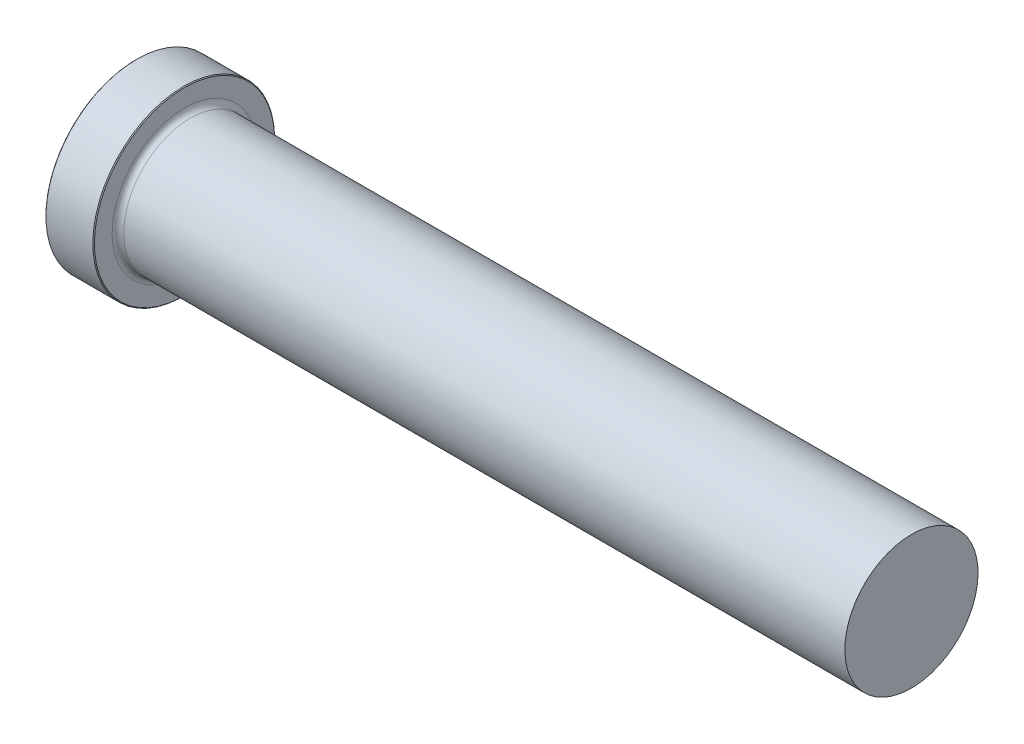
from build123d import *

# Parameters (mm, degrees)
CHAMFER1_SIZE = 0.1016


with BuildPart() as part:
    # Sketch1 → Revolve1 (revolve)
    with BuildSketch(Plane.XY):
        with BuildLine():
            Line((0, 0), (0, 11.90625))
            Line((0, 11.90625), (6.35, 11.90625))
            Line((6.35, 11.90625), (6.35, 9.4869))
            ThreePointArc((6.35, 9.4869), (6.573184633, 8.948084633), (7.112, 8.7249))
            Line((7.112, 8.7249), (101.6, 8.7249))
            Line((101.6, 8.7249), (101.6, 0))
            Line((101.6, 0), (0, 0))
        make_face()
    revolve(axis=Axis((101.6, 0, 0), (-1, 0, 0)))

    # Chamfer1
    chamfer1_edges = [part.edges().sort_by_distance(p)[0] for p in [
        (0, -11.90625, 0),
        (6.35, -11.90625, 0),
    ]]
    chamfer(chamfer1_edges, length=CHAMFER1_SIZE)


solid = part.part
